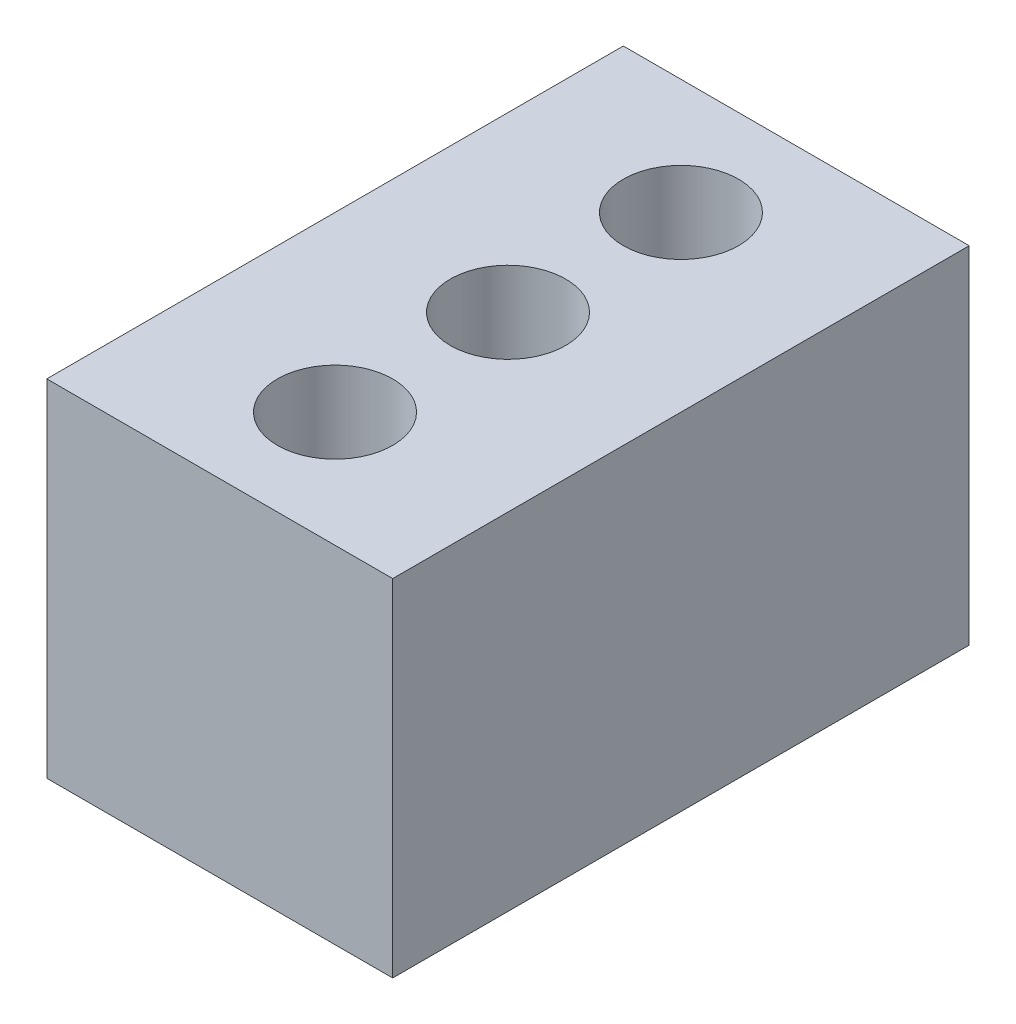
from build123d import *

# Parameters (mm, degrees)
ESQUISSE2_W                = 30
ESQUISSE2_H                = 30
EXTRUSION1_DEPTH           = 50
TROU_TARAUD_M121_D         = 10
R_P_TITION_LIN_AIRE1_COUNT = 2
R_P_TITION_LIN_AIRE1_PITCH = 18
R_P_TITION_LIN_AIRE2_COUNT = 2
R_P_TITION_LIN_AIRE2_PITCH = 18
R_P_TITION_LIN_AIRE4_COUNT = 3
R_P_TITION_LIN_AIRE4_PITCH = 15


with BuildPart() as part:
    # Esquisse2 → Extrusion1 (new body)
    with BuildSketch(Plane.XY):
        with Locations((15, -15)):
            Rectangle(ESQUISSE2_W, ESQUISSE2_H)
    extrude(amount=EXTRUSION1_DEPTH)

    # Trou taraud_ M121 (through all)
    with Locations(Plane(origin=(0, 0, 0), x_dir=(-1, 0, 0), z_dir=(0, 1, 0))):
        with Locations((-15, 40)):
            trou_taraud_m121 = Hole(TROU_TARAUD_M121_D / 2)

    # Esquisse6 → Trou taraud_ M61 (revolve, cut)
    with BuildSketch(Plane(origin=(6, -6, 0), x_dir=(0, 1, 0), z_dir=(1, 0, 0))):
        Polygon((0, 0), (0, 14.502151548), (2.5, 13), (2.5, 0), align=None)
    trou_taraud_m61 = revolve(axis=Axis((6, -6, -6.35), (0, 0, 1)), mode=Mode.SUBTRACT)

    # R_p_tition lin_aire1: Trou taraud_ M61 ×2
    with Locations(*[(i * R_P_TITION_LIN_AIRE1_PITCH, 0, 0) for i in range(1, R_P_TITION_LIN_AIRE1_COUNT)]):
        add(trou_taraud_m61, mode=Mode.SUBTRACT)

    # R_p_tition lin_aire2: Trou taraud_ M61 ×2
    with Locations(*[(0, -i * R_P_TITION_LIN_AIRE2_PITCH, 0) for i in range(1, R_P_TITION_LIN_AIRE2_COUNT)]):
        add(trou_taraud_m61, mode=Mode.SUBTRACT)

    # R_p_tition lin_aire2 copy 1 sketch → R_p_tition lin_aire2 copy 1 (revolve, cut)
    with BuildSketch(Plane(origin=(24, -24, 0), x_dir=(0, 1, 0), z_dir=(1, 0, 0))):
        Polygon((0, 0), (0, 14.502151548), (2.5, 13), (2.5, 0), align=None)
    revolve(axis=Axis((24, -24, -6.35), (0, 0, 1)), mode=Mode.SUBTRACT)

    # R_p_tition lin_aire4: Trou taraud_ M121 ×3
    with Locations(*[(0, 0, -i * R_P_TITION_LIN_AIRE4_PITCH) for i in range(1, R_P_TITION_LIN_AIRE4_COUNT)]):
        add(trou_taraud_m121, mode=Mode.SUBTRACT)


solid = part.part
